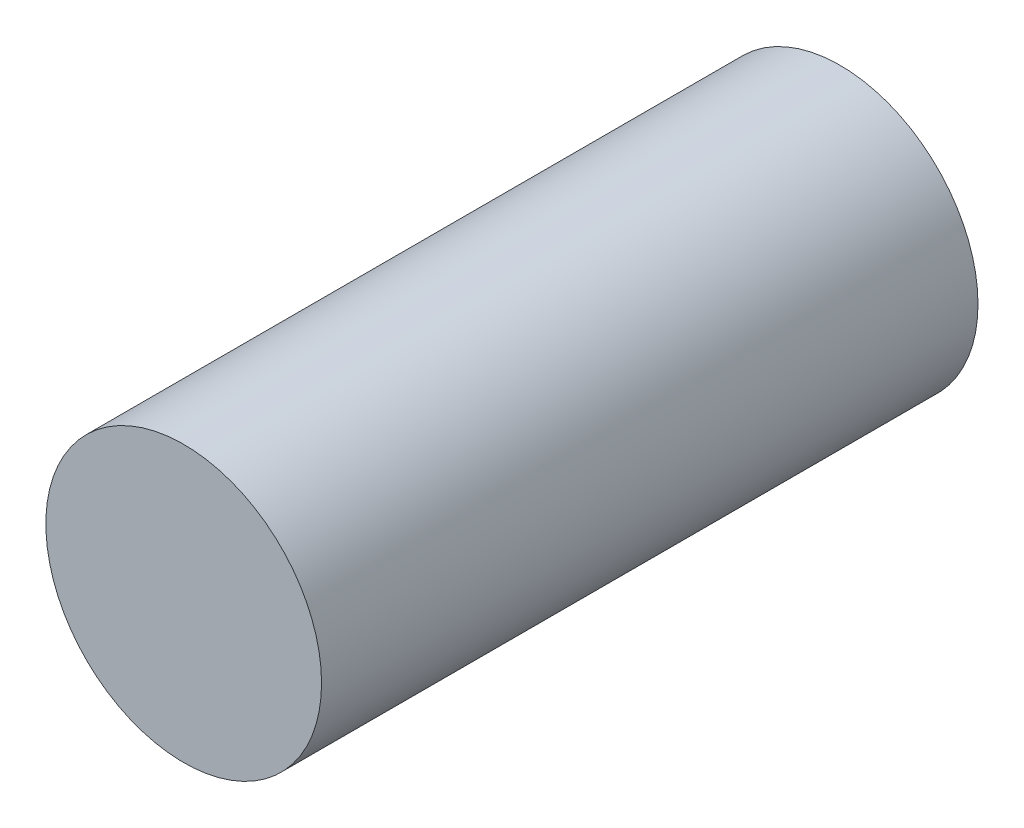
ISO-10303-21;
HEADER;
FILE_DESCRIPTION(('STEP AP214'),'2;1');
FILE_NAME('part.step','',(''),(''),'','','');
FILE_SCHEMA(('AUTOMOTIVE_DESIGN { 1 0 10303 214 1 1 1 1 }'));
ENDSEC;
DATA;
#1=APPLICATION_CONTEXT('core data for automotive mechanical design processes');
#2=APPLICATION_PROTOCOL_DEFINITION('international standard','automotive_design',2000,#1);
#3=PRODUCT_CONTEXT('',#1,'mechanical');
#4=PRODUCT('Part','Part','',(#3));
#5=PRODUCT_RELATED_PRODUCT_CATEGORY('part','',(#4));
#6=PRODUCT_DEFINITION_FORMATION('','',#4);
#7=PRODUCT_DEFINITION_CONTEXT('part definition',#1,'design');
#8=PRODUCT_DEFINITION('design','',#6,#7);
#9=PRODUCT_DEFINITION_SHAPE('','',#8);
#10=(LENGTH_UNIT() NAMED_UNIT(*) SI_UNIT(.MILLI.,.METRE.));
#11=(NAMED_UNIT(*) PLANE_ANGLE_UNIT() SI_UNIT($,.RADIAN.));
#12=(NAMED_UNIT(*) SI_UNIT($,.STERADIAN.) SOLID_ANGLE_UNIT());
#13=UNCERTAINTY_MEASURE_WITH_UNIT(LENGTH_MEASURE(1.E-05),#10,'distance_accuracy_value','');
#14=(GEOMETRIC_REPRESENTATION_CONTEXT(3) GLOBAL_UNCERTAINTY_ASSIGNED_CONTEXT((#13)) GLOBAL_UNIT_ASSIGNED_CONTEXT((#10,
#11,#12)) REPRESENTATION_CONTEXT('',''));
#15=CARTESIAN_POINT('',(0.,0.,0.));
#16=DIRECTION('',(0.,0.,1.));
#17=DIRECTION('',(1.,0.,0.));
#18=AXIS2_PLACEMENT_3D('',#15,#16,#17);
#19=CARTESIAN_POINT('',(0.,0.,50.));
#20=DIRECTION('',(0.,0.,-1.));
#21=DIRECTION('',(-1.,0.,0.));
#22=AXIS2_PLACEMENT_3D('',#19,#20,#21);
#23=CYLINDRICAL_SURFACE('',#22,10.5);
#24=CARTESIAN_POINT('',(0.,0.,50.));
#25=DIRECTION('',(0.,0.,1.));
#26=DIRECTION('',(1.,0.,0.));
#27=AXIS2_PLACEMENT_3D('',#24,#25,#26);
#28=CIRCLE('',#27,10.5);
#29=CARTESIAN_POINT('',(10.5,0.,50.));
#30=VERTEX_POINT('',#29);
#31=EDGE_CURVE('E10',#30,#30,#28,.T.);
#32=ORIENTED_EDGE('',*,*,#31,.F.);
#33=EDGE_LOOP('',(#32));
#34=FACE_BOUND('',#33,.T.);
#35=CARTESIAN_POINT('',(0.,0.,0.));
#36=DIRECTION('',(0.,0.,1.));
#37=DIRECTION('',(1.,0.,0.));
#38=AXIS2_PLACEMENT_3D('',#35,#36,#37);
#39=CIRCLE('',#38,10.5);
#40=CARTESIAN_POINT('',(10.5,0.,0.));
#41=VERTEX_POINT('',#40);
#42=EDGE_CURVE('E39',#41,#41,#39,.T.);
#43=ORIENTED_EDGE('',*,*,#42,.T.);
#44=EDGE_LOOP('',(#43));
#45=FACE_BOUND('',#44,.T.);
#46=ADVANCED_FACE('F36',(#34,#45),#23,.T.);
#47=CARTESIAN_POINT('',(0.,0.,50.));
#48=DIRECTION('',(0.,0.,1.));
#49=DIRECTION('',(1.,0.,0.));
#50=AXIS2_PLACEMENT_3D('',#47,#48,#49);
#51=PLANE('',#50);
#52=ORIENTED_EDGE('',*,*,#31,.T.);
#53=EDGE_LOOP('',(#52));
#54=FACE_BOUND('',#53,.T.);
#55=ADVANCED_FACE('F51',(#54),#51,.T.);
#56=CARTESIAN_POINT('',(0.,0.,0.));
#57=DIRECTION('',(0.,0.,1.));
#58=DIRECTION('',(1.,0.,0.));
#59=AXIS2_PLACEMENT_3D('',#56,#57,#58);
#60=PLANE('',#59);
#61=ORIENTED_EDGE('',*,*,#42,.F.);
#62=EDGE_LOOP('',(#61));
#63=FACE_BOUND('',#62,.T.);
#64=ADVANCED_FACE('F49',(#63),#60,.F.);
#65=CLOSED_SHELL('',(#46,#55,#64));
#66=MANIFOLD_SOLID_BREP('B2',#65);
#67=ADVANCED_BREP_SHAPE_REPRESENTATION('',(#18,#66),#14);
#68=SHAPE_DEFINITION_REPRESENTATION(#9,#67);
ENDSEC;
END-ISO-10303-21;
